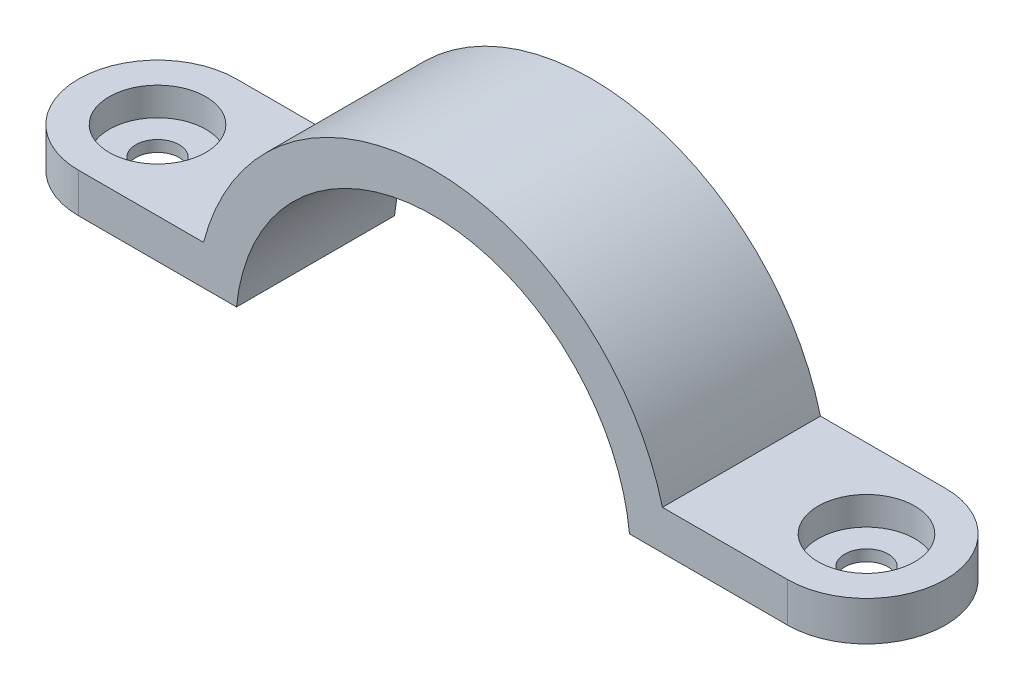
from build123d import *

# Parameters (mm, degrees)
EXTRUDE_THIN1_DEPTH                     = 10
FILLET1_RADIUS                          = 10
FILLET1_LENGTH                          = 5
FILLET2_RADIUS                          = 10
FILLET2_LENGTH                          = 5
CBORE_FOR_M5_HEX_HEAD_BOLT1_D           = 5.5
CBORE_FOR_M5_HEX_HEAD_BOLT1_CBORE_D     = 12.24
CBORE_FOR_M5_HEX_HEAD_BOLT1_CBORE_DEPTH = 3.58


with BuildPart() as part:
    # Sketch1 → Extrude-Thin1 (new, symmetric)
    with BuildSketch(Plane.XY):
        with BuildLine():
            Line((-54.874685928, 2.5), (-24.874685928, 2.5))
            ThreePointArc((-24.874685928, 2.5), (0, 25), (24.874685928, 2.5))
            Line((24.874685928, 2.5), (54.874685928, 2.5))
            Line((54.874685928, 2.5), (54.874685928, 7.5))
            Line((54.874685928, 7.5), (29.047375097, 7.5))
            ThreePointArc((29.047375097, 7.5), (0, 30), (-29.047375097, 7.5))
            Line((-29.047375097, 7.5), (-54.874685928, 7.5))
            Line((-54.874685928, 7.5), (-54.874685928, 2.5))
        make_face()
    extrude(amount=EXTRUDE_THIN1_DEPTH, both=True)

    # Fillet1: full round fillet: the end face becomes a half cylinder, R = half its width
    fillet1_face = Plane((54.874685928, 5, 0), x_dir=(0, -1, 0), z_dir=(1, 0, 0))  # on the end face: x along it, z out of the body
    fillet1_slab = fillet1_face.offset(-FILLET1_RADIUS / 2) * Box(FILLET1_LENGTH, 2 * FILLET1_RADIUS, FILLET1_RADIUS, mode=Mode.PRIVATE)  # the body's end, R deep
    fillet1_round = Plane((44.874685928, 5, 0), x_dir=(1, 0, 0), z_dir=(0, -1, 0)) * Cylinder(FILLET1_RADIUS, FILLET1_LENGTH, mode=Mode.PRIVATE)  # its axis R under the face
    add(fillet1_slab - fillet1_round, mode=Mode.SUBTRACT)

    # Fillet2: full round fillet: the end face becomes a half cylinder, R = half its width
    fillet2_face = Plane((-54.874685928, 5, 0), x_dir=(0, 1, 0), z_dir=(-1, 0, 0))  # on the end face: x along it, z out of the body
    fillet2_slab = fillet2_face.offset(-FILLET2_RADIUS / 2) * Box(FILLET2_LENGTH, 2 * FILLET2_RADIUS, FILLET2_RADIUS, mode=Mode.PRIVATE)  # the body's end, R deep
    fillet2_round = Plane((-44.874685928, 5, 0), x_dir=(-1, 0, 0), z_dir=(0, 1, 0)) * Cylinder(FILLET2_RADIUS, FILLET2_LENGTH, mode=Mode.PRIVATE)  # its axis R under the face
    add(fillet2_slab - fillet2_round, mode=Mode.SUBTRACT)

    # CBORE for M5 Hex Head Bolt1 (through all)
    with Locations(Plane(origin=(0, 7.5, 0), x_dir=(-1, 0, 0), z_dir=(0, 1, 0))):
        with Locations((-44.874685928, 0), (44.874685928, 0)):
            CounterBoreHole(CBORE_FOR_M5_HEX_HEAD_BOLT1_D / 2, CBORE_FOR_M5_HEX_HEAD_BOLT1_CBORE_D / 2, CBORE_FOR_M5_HEX_HEAD_BOLT1_CBORE_DEPTH)


solid = part.part
